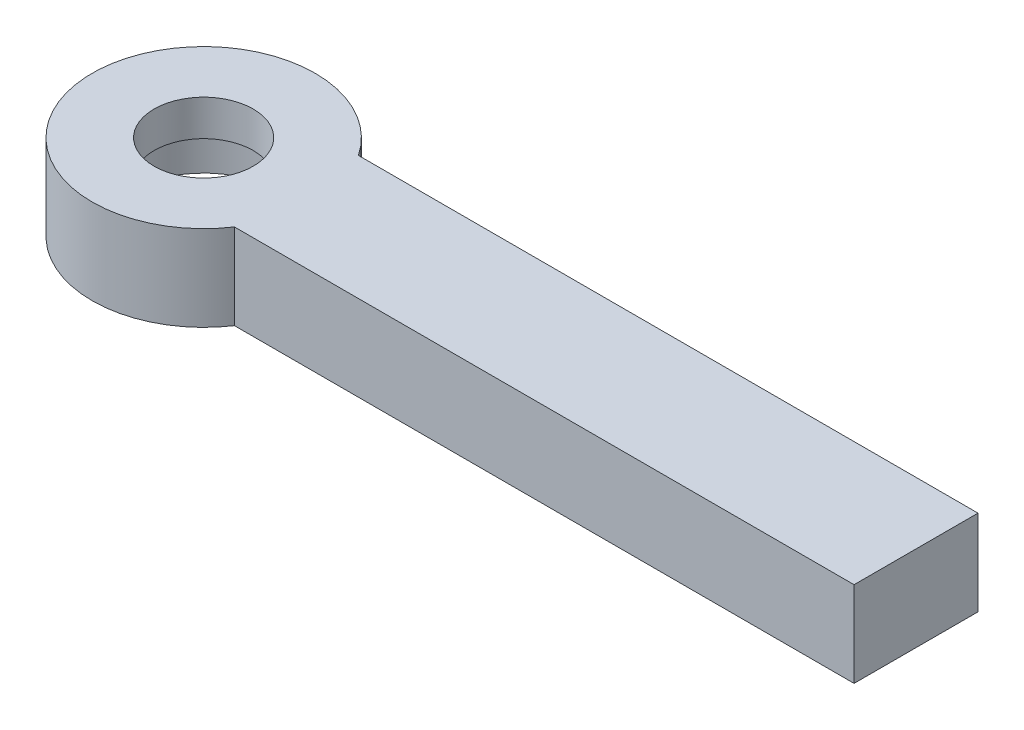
from build123d import *

# Parameters (mm, degrees)
SKETCH1_R           = 5.08
BOSS_EXTRUDE1_DEPTH = 8.763
SKETCH2_R           = 7.9375
CUT_EXTRUDE1_DEPTH  = 5.08


with BuildPart() as part:
    # Sketch1 → Boss-Extrude1 (new body)
    with BuildSketch(Plane(origin=(0, 0, 0), x_dir=(1, 0, 0), z_dir=(0, 1, 0))):
        with BuildLine():
            Line((9.503809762, -6.35), (73.003809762, -6.35))
            Line((73.003809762, -6.35), (73.003809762, 6.35))
            Line((73.003809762, 6.35), (9.503809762, 6.35))
            ThreePointArc((9.503809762, 6.35), (-11.43, 0), (9.503809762, -6.35))
        make_face()
        with Locations(Location((0, 0, 0), (0, 0, 270))):
            Circle(SKETCH1_R, mode=Mode.SUBTRACT)
    extrude(amount=BOSS_EXTRUDE1_DEPTH)

    # Sketch2 → Cut-Extrude1 (cut)
    with BuildSketch(Plane.XZ):
        with Locations(Location((0, 0, 0), (0, 0, 270))):
            Circle(SKETCH2_R)
    extrude(amount=-CUT_EXTRUDE1_DEPTH, mode=Mode.SUBTRACT)


solid = part.part
